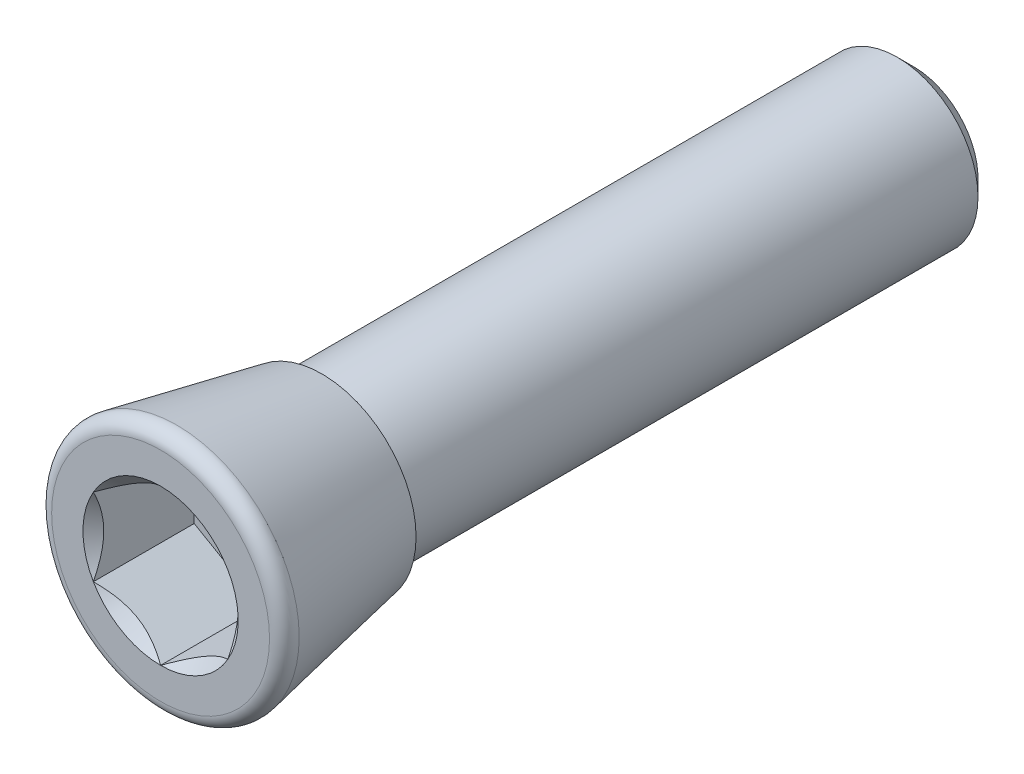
ISO-10303-21;
HEADER;
FILE_DESCRIPTION(('STEP AP214'),'2;1');
FILE_NAME('part.step','',(''),(''),'','','');
FILE_SCHEMA(('AUTOMOTIVE_DESIGN { 1 0 10303 214 1 1 1 1 }'));
ENDSEC;
DATA;
#1=APPLICATION_CONTEXT('core data for automotive mechanical design processes');
#2=APPLICATION_PROTOCOL_DEFINITION('international standard','automotive_design',2000,#1);
#3=PRODUCT_CONTEXT('',#1,'mechanical');
#4=PRODUCT('Part','Part','',(#3));
#5=PRODUCT_RELATED_PRODUCT_CATEGORY('part','',(#4));
#6=PRODUCT_DEFINITION_FORMATION('','',#4);
#7=PRODUCT_DEFINITION_CONTEXT('part definition',#1,'design');
#8=PRODUCT_DEFINITION('design','',#6,#7);
#9=PRODUCT_DEFINITION_SHAPE('','',#8);
#10=(LENGTH_UNIT() NAMED_UNIT(*) SI_UNIT(.MILLI.,.METRE.));
#11=(NAMED_UNIT(*) PLANE_ANGLE_UNIT() SI_UNIT($,.RADIAN.));
#12=(NAMED_UNIT(*) SI_UNIT($,.STERADIAN.) SOLID_ANGLE_UNIT());
#13=UNCERTAINTY_MEASURE_WITH_UNIT(LENGTH_MEASURE(1.E-05),#10,'distance_accuracy_value','');
#14=(GEOMETRIC_REPRESENTATION_CONTEXT(3) GLOBAL_UNCERTAINTY_ASSIGNED_CONTEXT((#13)) GLOBAL_UNIT_ASSIGNED_CONTEXT((#10,
#11,#12)) REPRESENTATION_CONTEXT('',''));
#15=CARTESIAN_POINT('',(0.,0.,0.));
#16=DIRECTION('',(0.,0.,1.));
#17=DIRECTION('',(1.,0.,0.));
#18=AXIS2_PLACEMENT_3D('',#15,#16,#17);
#19=CARTESIAN_POINT('',(0.,0.,0.));
#20=DIRECTION('',(0.,0.,1.));
#21=DIRECTION('',(1.,0.,0.));
#22=AXIS2_PLACEMENT_3D('',#19,#20,#21);
#23=PLANE('',#22);
#24=CARTESIAN_POINT('',(0.,0.,-8.64933125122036E-12));
#25=DIRECTION('',(0.,0.,1.));
#26=DIRECTION('',(1.,0.,0.));
#27=AXIS2_PLACEMENT_3D('',#24,#25,#26);
#28=CIRCLE('',#27,3.50127142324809);
#29=CARTESIAN_POINT('',(3.50127142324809,0.,-8.64933125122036E-12));
#30=VERTEX_POINT('',#29);
#31=EDGE_CURVE('E233',#30,#30,#28,.T.);
#32=ORIENTED_EDGE('',*,*,#31,.F.);
#33=EDGE_LOOP('',(#32));
#34=FACE_BOUND('',#33,.T.);
#35=CARTESIAN_POINT('',(0.,0.,0.));
#36=DIRECTION('',(0.,0.,1.));
#37=DIRECTION('',(1.,0.,0.));
#38=AXIS2_PLACEMENT_3D('',#35,#36,#37);
#39=CIRCLE('',#38,3.);
#40=CARTESIAN_POINT('',(3.,0.,0.));
#41=VERTEX_POINT('',#40);
#42=EDGE_CURVE('E310',#41,#41,#39,.F.);
#43=ORIENTED_EDGE('',*,*,#42,.F.);
#44=EDGE_LOOP('',(#43));
#45=FACE_BOUND('',#44,.T.);
#46=ADVANCED_FACE('F14',(#34,#45),#23,.F.);
#47=CARTESIAN_POINT('',(2.5,-1.44337567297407,2.25));
#48=DIRECTION('',(1.,0.,0.));
#49=DIRECTION('',(0.,-1.,0.));
#50=AXIS2_PLACEMENT_3D('',#47,#48,#49);
#51=PLANE('',#50);
#52=CARTESIAN_POINT('',(2.50000000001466,1.44337567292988,6.0000000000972));
#53=CARTESIAN_POINT('',(2.50000000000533,1.34480479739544,5.95076054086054));
#54=CARTESIAN_POINT('',(2.50000000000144,1.2445963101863,5.9043961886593));
#55=CARTESIAN_POINT('',(2.49999999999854,1.04022304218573,5.81940939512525));
#56=CARTESIAN_POINT('',(2.49999999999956,0.936037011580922,5.78083850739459));
#57=CARTESIAN_POINT('',(2.50000000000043,0.724653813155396,5.71423485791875));
#58=CARTESIAN_POINT('',(2.50000000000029,0.617468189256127,5.68616643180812));
#59=CARTESIAN_POINT('',(2.49999999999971,0.40074718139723,5.64295393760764));
#60=CARTESIAN_POINT('',(2.49999999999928,0.291220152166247,5.62776990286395));
#61=CARTESIAN_POINT('',(2.5000000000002,0.151078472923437,5.61762656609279));
#62=CARTESIAN_POINT('',(2.50000000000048,0.120877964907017,5.61598669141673));
#63=CARTESIAN_POINT('',(2.49999999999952,0.0604529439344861,5.61379762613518));
#64=CARTESIAN_POINT('',(2.49999999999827,0.0302284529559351,5.61324784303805));
#65=CARTESIAN_POINT('',(2.49999999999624,-0.0758674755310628,5.61325068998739));
#66=CARTESIAN_POINT('',(2.49999999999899,-0.151759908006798,5.61672098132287));
#67=CARTESIAN_POINT('',(2.50000000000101,-0.302963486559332,5.63041108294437));
#68=CARTESIAN_POINT('',(2.50000000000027,-0.378274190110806,5.64063560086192));
#69=CARTESIAN_POINT('',(2.49999999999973,-0.528122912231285,5.6673531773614));
#70=CARTESIAN_POINT('',(2.49999999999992,-0.602655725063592,5.68387509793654));
#71=CARTESIAN_POINT('',(2.50000000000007,-0.750290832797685,5.72243537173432));
#72=CARTESIAN_POINT('',(2.50000000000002,-0.823392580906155,5.74447579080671));
#73=CARTESIAN_POINT('',(2.49999999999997,-0.990079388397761,5.80069051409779));
#74=CARTESIAN_POINT('',(2.49999999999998,-1.08310139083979,5.83651478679));
#75=CARTESIAN_POINT('',(2.50000000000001,-1.26562346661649,5.91415730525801));
#76=CARTESIAN_POINT('',(2.50000000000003,-1.35514797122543,5.95591773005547));
#77=CARTESIAN_POINT('',(2.5,-1.44337567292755,6.00000000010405));
#78=B_SPLINE_CURVE_WITH_KNOTS('',3,(#52,#53,#54,#55,#56,#57,#58,#59,#60,#61,#62,#63,#64,#65,#66,
#67,#68,#69,#70,#71,#72,#73,#74,#75,#76,#77),.UNSPECIFIED.,.F.,.F.,(4,2,2,2,2,2,2,2,2,2,2,2,4),
(0.,0.330782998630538,0.663687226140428,0.995450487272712,1.32618083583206,1.41690228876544,
1.50757441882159,1.73514364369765,1.96287164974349,2.19165616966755,2.42052646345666,
2.71929868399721,3.0153381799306),.UNSPECIFIED.);
#79=CARTESIAN_POINT('',(2.49999999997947,1.44337567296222,6.0000000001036));
#80=VERTEX_POINT('',#79);
#81=CARTESIAN_POINT('',(2.49999999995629,-1.44337567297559,6.00000000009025));
#82=VERTEX_POINT('',#81);
#83=EDGE_CURVE('E69',#80,#82,#78,.T.);
#84=ORIENTED_EDGE('',*,*,#83,.F.);
#85=DIRECTION('',(0.,0.,-1.));
#86=VECTOR('',#85,1.);
#87=CARTESIAN_POINT('',(2.5,1.44337567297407,2.25));
#88=LINE('',#87,#86);
#89=CARTESIAN_POINT('',(2.5,1.44337567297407,2.25));
#90=VERTEX_POINT('',#89);
#91=EDGE_CURVE('E75',#80,#90,#88,.T.);
#92=ORIENTED_EDGE('',*,*,#91,.T.);
#93=DIRECTION('',(0.,1.,0.));
#94=VECTOR('',#93,1.);
#95=CARTESIAN_POINT('',(2.5,0.,2.25));
#96=LINE('',#95,#94);
#97=CARTESIAN_POINT('',(2.5,-1.44337567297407,2.25));
#98=VERTEX_POINT('',#97);
#99=EDGE_CURVE('E79',#90,#98,#96,.F.);
#100=ORIENTED_EDGE('',*,*,#99,.T.);
#101=DIRECTION('',(0.,0.,-1.));
#102=VECTOR('',#101,1.);
#103=CARTESIAN_POINT('',(2.5,-1.44337567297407,2.25));
#104=LINE('',#103,#102);
#105=EDGE_CURVE('E77',#98,#82,#104,.F.);
#106=ORIENTED_EDGE('',*,*,#105,.T.);
#107=EDGE_LOOP('',(#84,#92,#100,#106));
#108=FACE_BOUND('',#107,.T.);
#109=ADVANCED_FACE('F73',(#108),#51,.F.);
#110=CARTESIAN_POINT('',(5.,0.,2.25));
#111=DIRECTION('',(0.,0.,-1.));
#112=DIRECTION('',(-1.,0.,0.));
#113=AXIS2_PLACEMENT_3D('',#110,#111,#112);
#114=PLANE('',#113);
#115=DIRECTION('',(0.866025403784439,0.5,0.));
#116=VECTOR('',#115,1.);
#117=CARTESIAN_POINT('',(0.,2.88675134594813,2.25));
#118=LINE('',#117,#116);
#119=CARTESIAN_POINT('',(0.,2.88675134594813,2.25));
#120=VERTEX_POINT('',#119);
#121=CARTESIAN_POINT('',(-2.5,1.44337567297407,2.25));
#122=VERTEX_POINT('',#121);
#123=EDGE_CURVE('E267',#120,#122,#118,.F.);
#124=ORIENTED_EDGE('',*,*,#123,.T.);
#125=DIRECTION('',(0.,1.,0.));
#126=VECTOR('',#125,1.);
#127=CARTESIAN_POINT('',(-2.5,1.44337567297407,2.25));
#128=LINE('',#127,#126);
#129=CARTESIAN_POINT('',(-2.5,-1.44337567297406,2.25));
#130=VERTEX_POINT('',#129);
#131=EDGE_CURVE('E273',#122,#130,#128,.F.);
#132=ORIENTED_EDGE('',*,*,#131,.T.);
#133=DIRECTION('',(-0.866025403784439,0.5,0.));
#134=VECTOR('',#133,1.);
#135=CARTESIAN_POINT('',(-2.5,-1.44337567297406,2.25));
#136=LINE('',#135,#134);
#137=CARTESIAN_POINT('',(0.,-2.88675134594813,2.25));
#138=VERTEX_POINT('',#137);
#139=EDGE_CURVE('E279',#130,#138,#136,.F.);
#140=ORIENTED_EDGE('',*,*,#139,.T.);
#141=DIRECTION('',(-0.866025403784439,-0.5,0.));
#142=VECTOR('',#141,1.);
#143=CARTESIAN_POINT('',(0.,-2.88675134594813,2.25));
#144=LINE('',#143,#142);
#145=EDGE_CURVE('E100',#138,#98,#144,.F.);
#146=ORIENTED_EDGE('',*,*,#145,.T.);
#147=ORIENTED_EDGE('',*,*,#99,.F.);
#148=DIRECTION('',(0.866025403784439,-0.5,0.));
#149=VECTOR('',#148,1.);
#150=CARTESIAN_POINT('',(2.5,1.44337567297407,2.25));
#151=LINE('',#150,#149);
#152=EDGE_CURVE('E99',#90,#120,#151,.F.);
#153=ORIENTED_EDGE('',*,*,#152,.T.);
#154=EDGE_LOOP('',(#124,#132,#140,#146,#147,#153));
#155=FACE_BOUND('',#154,.T.);
#156=ADVANCED_FACE('F182',(#155),#114,.F.);
#157=CARTESIAN_POINT('',(2.5,1.44337567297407,2.25));
#158=DIRECTION('',(0.5,0.866025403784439,0.));
#159=DIRECTION('',(0.866025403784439,-0.5,0.));
#160=AXIS2_PLACEMENT_3D('',#157,#158,#159);
#161=PLANE('',#160);
#162=CARTESIAN_POINT('',(2.49999999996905,1.44337567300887,6.0000000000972));
#163=CARTESIAN_POINT('',(2.41407377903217,1.49298519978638,5.9504380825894));
#164=CARTESIAN_POINT('',(2.32671086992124,1.54342419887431,5.90378750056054));
#165=CARTESIAN_POINT('',(2.14856893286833,1.64627449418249,5.81837227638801));
#166=CARTESIAN_POINT('',(2.05777297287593,1.69869556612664,5.77965514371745));
#167=CARTESIAN_POINT('',(1.87468737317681,1.80440008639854,5.71333243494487));
#168=CARTESIAN_POINT('',(1.78244433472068,1.85765662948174,5.68556020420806));
#169=CARTESIAN_POINT('',(1.59592809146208,1.9653418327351,5.64277179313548));
#170=CARTESIAN_POINT('',(1.5016605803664,2.01976720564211,5.62772368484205));
#171=CARTESIAN_POINT('',(1.33918618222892,2.11357184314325,5.61414605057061));
#172=CARTESIAN_POINT('',(1.27118905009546,2.15283000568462,5.61213672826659));
#173=CARTESIAN_POINT('',(1.13530604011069,2.23128209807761,5.61552620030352));
#174=CARTESIAN_POINT('',(1.06742020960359,2.27047600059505,5.62092759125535));
#175=CARTESIAN_POINT('',(0.932289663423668,2.34849365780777,5.6388311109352));
#176=CARTESIAN_POINT('',(0.865045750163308,2.38731694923,5.65134117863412));
#177=CARTESIAN_POINT('',(0.73172077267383,2.46429216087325,5.68277536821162));
#178=CARTESIAN_POINT('',(0.665639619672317,2.50244413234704,5.70169899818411));
#179=CARTESIAN_POINT('',(0.496416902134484,2.60014491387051,5.75786430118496));
#180=CARTESIAN_POINT('',(0.394323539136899,2.65908854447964,5.79933497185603));
#181=CARTESIAN_POINT('',(0.244203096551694,2.74576062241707,5.86934112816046));
#182=CARTESIAN_POINT('',(0.194731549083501,2.77432303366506,5.89393775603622));
#183=CARTESIAN_POINT('',(0.0967044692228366,2.83091899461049,5.94537285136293));
#184=CARTESIAN_POINT('',(0.0481483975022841,2.85895285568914,5.97220994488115));
#185=CARTESIAN_POINT('',(3.89630262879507E-11,2.88675134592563,6.00000000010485));
#186=B_SPLINE_CURVE_WITH_KNOTS('',3,(#162,#163,#164,#165,#166,#167,#168,#169,#170,#171,#172,
#173,#174,#175,#176,#177,#178,#179,#180,#181,#182,#183,#184,#185),.UNSPECIFIED.,.F.,.F.,(4,2,2,
2,2,2,2,2,2,2,2,4),(0.,0.332957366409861,0.667853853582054,0.997433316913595,1.32618330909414,
1.56147590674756,1.79685096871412,2.03248941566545,2.26810979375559,2.64223182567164,
2.82878537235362,3.01522534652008),.UNSPECIFIED.);
#187=CARTESIAN_POINT('',(0.,2.88675134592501,6.0000000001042));
#188=VERTEX_POINT('',#187);
#189=EDGE_CURVE('E96',#80,#188,#186,.T.);
#190=ORIENTED_EDGE('',*,*,#189,.T.);
#191=DIRECTION('',(0.,0.,-1.));
#192=VECTOR('',#191,1.);
#193=CARTESIAN_POINT('',(0.,2.88675134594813,2.25));
#194=LINE('',#193,#192);
#195=EDGE_CURVE('E106',#188,#120,#194,.T.);
#196=ORIENTED_EDGE('',*,*,#195,.T.);
#197=ORIENTED_EDGE('',*,*,#152,.F.);
#198=ORIENTED_EDGE('',*,*,#91,.F.);
#199=EDGE_LOOP('',(#190,#196,#197,#198));
#200=FACE_BOUND('',#199,.T.);
#201=ADVANCED_FACE('F94',(#200),#161,.F.);
#202=CARTESIAN_POINT('',(0.,-2.88675134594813,2.25));
#203=DIRECTION('',(0.5,-0.866025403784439,0.));
#204=DIRECTION('',(-0.866025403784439,-0.5,0.));
#205=AXIS2_PLACEMENT_3D('',#202,#203,#204);
#206=PLANE('',#205);
#207=CARTESIAN_POINT('',(4.47840873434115E-11,-2.88675134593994,6.0000000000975));
#208=CARTESIAN_POINT('',(0.0859262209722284,-2.83714181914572,5.95043808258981));
#209=CARTESIAN_POINT('',(0.173289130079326,-2.7867028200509,5.90378750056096));
#210=CARTESIAN_POINT('',(0.351431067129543,-2.68385252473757,5.81837227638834));
#211=CARTESIAN_POINT('',(0.442227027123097,-2.63143145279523,5.77965514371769));
#212=CARTESIAN_POINT('',(0.625312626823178,-2.52572693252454,5.71333243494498));
#213=CARTESIAN_POINT('',(0.717555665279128,-2.4724703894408,5.68556020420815));
#214=CARTESIAN_POINT('',(0.904071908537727,-2.36478518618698,5.64277179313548));
#215=CARTESIAN_POINT('',(0.998339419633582,-2.31035981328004,5.627723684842));
#216=CARTESIAN_POINT('',(1.16081381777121,-2.2165551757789,5.61414605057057));
#217=CARTESIAN_POINT('',(1.22881094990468,-2.17729701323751,5.61213672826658));
#218=CARTESIAN_POINT('',(1.36469395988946,-2.09884492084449,5.61552620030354));
#219=CARTESIAN_POINT('',(1.43257979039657,-2.05965101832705,5.62092759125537));
#220=CARTESIAN_POINT('',(1.56771033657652,-1.98163336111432,5.63883111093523));
#221=CARTESIAN_POINT('',(1.63495424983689,-1.94281006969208,5.65134117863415));
#222=CARTESIAN_POINT('',(1.76827922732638,-1.86583485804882,5.68277536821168));
#223=CARTESIAN_POINT('',(1.8343603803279,-1.82768288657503,5.7016989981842));
#224=CARTESIAN_POINT('',(2.00358309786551,-1.7299821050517,5.757864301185));
#225=CARTESIAN_POINT('',(2.10567646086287,-1.67103847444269,5.79933497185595));
#226=CARTESIAN_POINT('',(2.25579690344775,-1.58436639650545,5.86934112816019));
#227=CARTESIAN_POINT('',(2.30526845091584,-1.55580398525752,5.89393775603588));
#228=CARTESIAN_POINT('',(2.40329553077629,-1.49920802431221,5.94537285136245));
#229=CARTESIAN_POINT('',(2.45185160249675,-1.47117416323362,5.9722099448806));
#230=CARTESIAN_POINT('',(2.49999999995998,-1.44337567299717,6.0000000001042));
#231=B_SPLINE_CURVE_WITH_KNOTS('',3,(#207,#208,#209,#210,#211,#212,#213,#214,#215,#216,#217,
#218,#219,#220,#221,#222,#223,#224,#225,#226,#227,#228,#229,#230),.UNSPECIFIED.,.F.,.F.,(4,2,2,
2,2,2,2,2,2,2,2,4),(0.,0.332957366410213,0.667853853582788,0.997433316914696,1.32618330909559,
1.56147590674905,1.79685096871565,2.03248941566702,2.2681097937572,2.64223182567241,
2.82878537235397,3.01522534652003),.UNSPECIFIED.);
#232=CARTESIAN_POINT('',(-2.36829088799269E-11,-2.88675134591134,6.00000000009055));
#233=VERTEX_POINT('',#232);
#234=EDGE_CURVE('E105',#233,#82,#231,.T.);
#235=ORIENTED_EDGE('',*,*,#234,.T.);
#236=ORIENTED_EDGE('',*,*,#105,.F.);
#237=ORIENTED_EDGE('',*,*,#145,.F.);
#238=DIRECTION('',(0.,0.,-1.));
#239=VECTOR('',#238,1.);
#240=CARTESIAN_POINT('',(0.,-2.88675134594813,2.25));
#241=LINE('',#240,#239);
#242=EDGE_CURVE('E276',#138,#233,#241,.F.);
#243=ORIENTED_EDGE('',*,*,#242,.T.);
#244=EDGE_LOOP('',(#235,#236,#237,#243));
#245=FACE_BOUND('',#244,.T.);
#246=ADVANCED_FACE('F172',(#245),#206,.F.);
#247=CARTESIAN_POINT('',(-2.5,-1.44337567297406,2.25));
#248=DIRECTION('',(-0.5,-0.866025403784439,0.));
#249=DIRECTION('',(-0.866025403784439,0.5,0.));
#250=AXIS2_PLACEMENT_3D('',#247,#248,#249);
#251=PLANE('',#250);
#252=CARTESIAN_POINT('',(-2.49999999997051,-1.44337567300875,6.0000000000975));
#253=CARTESIAN_POINT('',(-2.41407377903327,-1.49298519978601,5.95043808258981));
#254=CARTESIAN_POINT('',(-2.32671086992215,-1.54342419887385,5.90378750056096));
#255=CARTESIAN_POINT('',(-2.14856893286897,-1.64627449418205,5.81837227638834));
#256=CARTESIAN_POINT('',(-2.05777297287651,-1.69869556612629,5.77965514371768));
#257=CARTESIAN_POINT('',(-1.87468737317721,-1.80440008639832,5.71333243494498));
#258=CARTESIAN_POINT('',(-1.78244433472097,-1.85765662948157,5.68556020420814));
#259=CARTESIAN_POINT('',(-1.59592809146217,-1.96534183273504,5.64277179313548));
#260=CARTESIAN_POINT('',(-1.5016605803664,-2.01976720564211,5.627723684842));
#261=CARTESIAN_POINT('',(-1.33918618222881,-2.11357184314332,5.61414605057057));
#262=CARTESIAN_POINT('',(-1.27118905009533,-2.15283000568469,5.61213672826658));
#263=CARTESIAN_POINT('',(-1.13530604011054,-2.2312820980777,5.61552620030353));
#264=CARTESIAN_POINT('',(-1.06742020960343,-2.27047600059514,5.62092759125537));
#265=CARTESIAN_POINT('',(-0.932289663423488,-2.34849365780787,5.63883111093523));
#266=CARTESIAN_POINT('',(-0.865045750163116,-2.38731694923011,5.65134117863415));
#267=CARTESIAN_POINT('',(-0.731720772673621,-2.46429216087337,5.68277536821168));
#268=CARTESIAN_POINT('',(-0.665639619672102,-2.50244413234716,5.7016989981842));
#269=CARTESIAN_POINT('',(-0.496416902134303,-2.60014491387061,5.75786430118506));
#270=CARTESIAN_POINT('',(-0.394323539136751,-2.65908854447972,5.7993349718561));
#271=CARTESIAN_POINT('',(-0.244203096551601,-2.74576062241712,5.8693411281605));
#272=CARTESIAN_POINT('',(-0.194731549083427,-2.7743230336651,5.89393775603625));
#273=CARTESIAN_POINT('',(-0.0967044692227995,-2.8309189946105,5.94537285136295));
#274=CARTESIAN_POINT('',(-0.048148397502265,-2.85895285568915,5.97220994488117));
#275=CARTESIAN_POINT('',(-3.89606769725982E-11,-2.88675134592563,6.00000000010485));
#276=B_SPLINE_CURVE_WITH_KNOTS('',3,(#252,#253,#254,#255,#256,#257,#258,#259,#260,#261,#262,
#263,#264,#265,#266,#267,#268,#269,#270,#271,#272,#273,#274,#275),.UNSPECIFIED.,.F.,.F.,(4,2,2,
2,2,2,2,2,2,2,2,4),(0.,0.332957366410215,0.667853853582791,0.997433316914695,1.32618330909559,
1.56147590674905,1.79685096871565,2.03248941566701,2.2681097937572,2.64223182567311,
2.82878537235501,3.01522534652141),.UNSPECIFIED.);
#277=CARTESIAN_POINT('',(-2.49999999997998,-1.44337567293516,6.0000000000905));
#278=VERTEX_POINT('',#277);
#279=EDGE_CURVE('E155',#278,#233,#276,.T.);
#280=ORIENTED_EDGE('',*,*,#279,.T.);
#281=ORIENTED_EDGE('',*,*,#242,.F.);
#282=ORIENTED_EDGE('',*,*,#139,.F.);
#283=DIRECTION('',(0.,0.,1.));
#284=VECTOR('',#283,1.);
#285=CARTESIAN_POINT('',(-2.5,-1.44337567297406,2.25));
#286=LINE('',#285,#284);
#287=EDGE_CURVE('E270',#130,#278,#286,.T.);
#288=ORIENTED_EDGE('',*,*,#287,.T.);
#289=EDGE_LOOP('',(#280,#281,#282,#288));
#290=FACE_BOUND('',#289,.T.);
#291=ADVANCED_FACE('F168',(#290),#251,.F.);
#292=CARTESIAN_POINT('',(-2.5,1.44337567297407,2.25));
#293=DIRECTION('',(-1.,0.,0.));
#294=DIRECTION('',(0.,0.,1.));
#295=AXIS2_PLACEMENT_3D('',#292,#293,#294);
#296=PLANE('',#295);
#297=CARTESIAN_POINT('',(-2.5000000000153,1.44337567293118,6.0000000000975));
#298=CARTESIAN_POINT('',(-2.5000000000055,1.34415661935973,5.95043808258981));
#299=CARTESIAN_POINT('',(-2.50000000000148,1.24327862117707,5.90378750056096));
#300=CARTESIAN_POINT('',(-2.49999999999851,1.03757803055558,5.81837227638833));
#301=CARTESIAN_POINT('',(-2.4999999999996,0.932735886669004,5.77965514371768));
#302=CARTESIAN_POINT('',(-2.50000000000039,0.721326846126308,5.71333243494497));
#303=CARTESIAN_POINT('',(-2.5000000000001,0.61481375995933,5.68556020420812));
#304=CARTESIAN_POINT('',(-2.4999999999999,0.399443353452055,5.64277179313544));
#305=CARTESIAN_POINT('',(-2.49999999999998,0.290592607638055,5.62772368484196));
#306=CARTESIAN_POINT('',(-2.50000000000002,0.102983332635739,5.61414605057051));
#307=CARTESIAN_POINT('',(-2.5,0.0244670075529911,5.61213672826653));
#308=CARTESIAN_POINT('',(-2.5,-0.132437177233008,5.61552620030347));
#309=CARTESIAN_POINT('',(-2.5,-0.210824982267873,5.6209275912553));
#310=CARTESIAN_POINT('',(-2.5,-0.366860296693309,5.63883111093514));
#311=CARTESIAN_POINT('',(-2.5,-0.444506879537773,5.65134117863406));
#312=CARTESIAN_POINT('',(-2.5,-0.598457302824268,5.68277536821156));
#313=CARTESIAN_POINT('',(-2.5,-0.674761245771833,5.70169899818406));
#314=CARTESIAN_POINT('',(-2.5,-0.870162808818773,5.75786430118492));
#315=CARTESIAN_POINT('',(-2.5,-0.988050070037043,5.79933497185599));
#316=CARTESIAN_POINT('',(-2.5,-1.16139422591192,5.86934112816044));
#317=CARTESIAN_POINT('',(-2.5,-1.21851904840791,5.89393775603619));
#318=CARTESIAN_POINT('',(-2.5,-1.33171097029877,5.94537285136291));
#319=CARTESIAN_POINT('',(-2.5,-1.38777869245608,5.97220994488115));
#320=CARTESIAN_POINT('',(-2.5,-1.44337567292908,6.00000000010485));
#321=B_SPLINE_CURVE_WITH_KNOTS('',3,(#297,#298,#299,#300,#301,#302,#303,#304,#305,#306,#307,
#308,#309,#310,#311,#312,#313,#314,#315,#316,#317,#318,#319,#320),.UNSPECIFIED.,.F.,.F.,(4,2,2,
2,2,2,2,2,2,2,2,4),(0.,0.332957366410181,0.667853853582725,0.997433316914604,1.32618330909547,
1.56147590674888,1.79685096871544,2.03248941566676,2.2681097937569,2.64223182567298,
2.82878537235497,3.01522534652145),.UNSPECIFIED.);
#322=CARTESIAN_POINT('',(-2.49999999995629,1.44337567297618,6.00000000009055));
#323=VERTEX_POINT('',#322);
#324=EDGE_CURVE('E115',#323,#278,#321,.T.);
#325=ORIENTED_EDGE('',*,*,#324,.T.);
#326=ORIENTED_EDGE('',*,*,#287,.F.);
#327=ORIENTED_EDGE('',*,*,#131,.F.);
#328=DIRECTION('',(0.,0.,-1.));
#329=VECTOR('',#328,1.);
#330=CARTESIAN_POINT('',(-2.5,1.44337567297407,2.25));
#331=LINE('',#330,#329);
#332=EDGE_CURVE('E262',#122,#323,#331,.F.);
#333=ORIENTED_EDGE('',*,*,#332,.T.);
#334=EDGE_LOOP('',(#325,#326,#327,#333));
#335=FACE_BOUND('',#334,.T.);
#336=ADVANCED_FACE('F171',(#335),#296,.F.);
#337=CARTESIAN_POINT('',(0.,2.88675134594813,2.25));
#338=DIRECTION('',(-0.5,0.866025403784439,0.));
#339=DIRECTION('',(0.866025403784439,0.5,0.));
#340=AXIS2_PLACEMENT_3D('',#337,#338,#339);
#341=PLANE('',#340);
#342=CARTESIAN_POINT('',(-4.47876154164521E-11,2.88675134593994,6.0000000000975));
#343=CARTESIAN_POINT('',(-0.0859262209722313,2.83714181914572,5.95043808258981));
#344=CARTESIAN_POINT('',(-0.173289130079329,2.7867028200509,5.90378750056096));
#345=CARTESIAN_POINT('',(-0.351431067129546,2.68385252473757,5.81837227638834));
#346=CARTESIAN_POINT('',(-0.442227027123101,2.63143145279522,5.77965514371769));
#347=CARTESIAN_POINT('',(-0.625312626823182,2.52572693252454,5.71333243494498));
#348=CARTESIAN_POINT('',(-0.717555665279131,2.4724703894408,5.68556020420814));
#349=CARTESIAN_POINT('',(-0.904071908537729,2.36478518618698,5.64277179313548));
#350=CARTESIAN_POINT('',(-0.998339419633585,2.31035981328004,5.627723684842));
#351=CARTESIAN_POINT('',(-1.16081381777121,2.2165551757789,5.61414605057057));
#352=CARTESIAN_POINT('',(-1.22881094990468,2.17729701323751,5.61213672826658));
#353=CARTESIAN_POINT('',(-1.36469395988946,2.09884492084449,5.61552620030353));
#354=CARTESIAN_POINT('',(-1.43257979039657,2.05965101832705,5.62092759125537));
#355=CARTESIAN_POINT('',(-1.56771033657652,1.98163336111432,5.63883111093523));
#356=CARTESIAN_POINT('',(-1.63495424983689,1.94281006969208,5.65134117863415));
#357=CARTESIAN_POINT('',(-1.76827922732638,1.86583485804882,5.68277536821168));
#358=CARTESIAN_POINT('',(-1.8343603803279,1.82768288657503,5.7016989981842));
#359=CARTESIAN_POINT('',(-2.0035830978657,1.72998210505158,5.75786430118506));
#360=CARTESIAN_POINT('',(-2.10567646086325,1.67103847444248,5.7993349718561));
#361=CARTESIAN_POINT('',(-2.2557969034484,1.58436639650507,5.86934112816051));
#362=CARTESIAN_POINT('',(-2.30526845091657,1.5558039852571,5.89393775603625));
#363=CARTESIAN_POINT('',(-2.4032955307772,1.49920802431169,5.94537285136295));
#364=CARTESIAN_POINT('',(-2.45185160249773,1.47117416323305,5.97220994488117));
#365=CARTESIAN_POINT('',(-2.49999999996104,1.44337567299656,6.00000000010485));
#366=B_SPLINE_CURVE_WITH_KNOTS('',3,(#342,#343,#344,#345,#346,#347,#348,#349,#350,#351,#352,
#353,#354,#355,#356,#357,#358,#359,#360,#361,#362,#363,#364,#365),.UNSPECIFIED.,.F.,.F.,(4,2,2,
2,2,2,2,2,2,2,2,4),(0.,0.332957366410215,0.66785385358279,0.997433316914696,1.32618330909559,
1.56147590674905,1.79685096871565,2.03248941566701,2.2681097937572,2.6422318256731,
2.82878537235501,3.01522534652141),.UNSPECIFIED.);
#367=EDGE_CURVE('E112',#188,#323,#366,.T.);
#368=ORIENTED_EDGE('',*,*,#367,.T.);
#369=ORIENTED_EDGE('',*,*,#332,.F.);
#370=ORIENTED_EDGE('',*,*,#123,.F.);
#371=ORIENTED_EDGE('',*,*,#195,.F.);
#372=EDGE_LOOP('',(#368,#369,#370,#371));
#373=FACE_BOUND('',#372,.T.);
#374=ADVANCED_FACE('F132',(#373),#341,.F.);
#375=CARTESIAN_POINT('',(0.,0.,6.00000000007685));
#376=DIRECTION('',(0.,0.,1.));
#377=DIRECTION('',(1.,0.,0.));
#378=AXIS2_PLACEMENT_3D('',#375,#376,#377);
#379=CONICAL_SURFACE('',#378,2.88675134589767,0.785398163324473);
#380=ORIENTED_EDGE('',*,*,#189,.F.);
#381=CARTESIAN_POINT('',(0.,0.,6.00000000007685));
#382=DIRECTION('',(0.,0.,1.));
#383=DIRECTION('',(1.,0.,0.));
#384=AXIS2_PLACEMENT_3D('',#381,#382,#383);
#385=CIRCLE('',#384,2.88675134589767);
#386=EDGE_CURVE('E88',#188,#80,#385,.F.);
#387=ORIENTED_EDGE('',*,*,#386,.F.);
#388=EDGE_LOOP('',(#380,#387));
#389=FACE_BOUND('',#388,.T.);
#390=ADVANCED_FACE('F104',(#389),#379,.F.);
#391=CARTESIAN_POINT('',(0.,0.,6.00000000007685));
#392=DIRECTION('',(0.,0.,1.));
#393=DIRECTION('',(1.,0.,0.));
#394=AXIS2_PLACEMENT_3D('',#391,#392,#393);
#395=CONICAL_SURFACE('',#394,2.88675134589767,0.785398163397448);
#396=ORIENTED_EDGE('',*,*,#83,.T.);
#397=CARTESIAN_POINT('',(0.,0.,6.00000000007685));
#398=DIRECTION('',(0.,0.,1.));
#399=DIRECTION('',(1.,0.,0.));
#400=AXIS2_PLACEMENT_3D('',#397,#398,#399);
#401=CIRCLE('',#400,2.88675134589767);
#402=EDGE_CURVE('E81',#80,#82,#401,.F.);
#403=ORIENTED_EDGE('',*,*,#402,.F.);
#404=EDGE_LOOP('',(#396,#403));
#405=FACE_BOUND('',#404,.T.);
#406=ADVANCED_FACE('F82',(#405),#395,.F.);
#407=CARTESIAN_POINT('',(0.,0.,6.00000000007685));
#408=DIRECTION('',(0.,0.,1.));
#409=DIRECTION('',(1.,0.,0.));
#410=AXIS2_PLACEMENT_3D('',#407,#408,#409);
#411=CONICAL_SURFACE('',#410,2.88675134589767,0.785398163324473);
#412=ORIENTED_EDGE('',*,*,#234,.F.);
#413=CARTESIAN_POINT('',(0.,0.,6.00000000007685));
#414=DIRECTION('',(0.,0.,1.));
#415=DIRECTION('',(1.,0.,0.));
#416=AXIS2_PLACEMENT_3D('',#413,#414,#415);
#417=CIRCLE('',#416,2.88675134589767);
#418=EDGE_CURVE('E87',#82,#233,#417,.F.);
#419=ORIENTED_EDGE('',*,*,#418,.F.);
#420=EDGE_LOOP('',(#412,#419));
#421=FACE_BOUND('',#420,.T.);
#422=ADVANCED_FACE('F151',(#421),#411,.F.);
#423=CARTESIAN_POINT('',(0.,0.,6.00000000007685));
#424=DIRECTION('',(0.,0.,1.));
#425=DIRECTION('',(1.,0.,0.));
#426=AXIS2_PLACEMENT_3D('',#423,#424,#425);
#427=CONICAL_SURFACE('',#426,2.88675134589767,0.785398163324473);
#428=ORIENTED_EDGE('',*,*,#279,.F.);
#429=CARTESIAN_POINT('',(0.,0.,6.00000000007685));
#430=DIRECTION('',(0.,0.,1.));
#431=DIRECTION('',(1.,0.,0.));
#432=AXIS2_PLACEMENT_3D('',#429,#430,#431);
#433=CIRCLE('',#432,2.88675134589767);
#434=EDGE_CURVE('E314',#233,#278,#433,.F.);
#435=ORIENTED_EDGE('',*,*,#434,.F.);
#436=EDGE_LOOP('',(#428,#435));
#437=FACE_BOUND('',#436,.T.);
#438=ADVANCED_FACE('F146',(#437),#427,.F.);
#439=CARTESIAN_POINT('',(0.,0.,6.00000000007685));
#440=DIRECTION('',(0.,0.,1.));
#441=DIRECTION('',(1.,0.,0.));
#442=AXIS2_PLACEMENT_3D('',#439,#440,#441);
#443=CONICAL_SURFACE('',#442,2.88675134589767,0.785398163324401);
#444=ORIENTED_EDGE('',*,*,#324,.F.);
#445=CARTESIAN_POINT('',(0.,0.,6.00000000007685));
#446=DIRECTION('',(0.,0.,1.));
#447=DIRECTION('',(1.,0.,0.));
#448=AXIS2_PLACEMENT_3D('',#445,#446,#447);
#449=CIRCLE('',#448,2.88675134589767);
#450=EDGE_CURVE('E312',#278,#323,#449,.F.);
#451=ORIENTED_EDGE('',*,*,#450,.F.);
#452=EDGE_LOOP('',(#444,#451));
#453=FACE_BOUND('',#452,.T.);
#454=ADVANCED_FACE('F139',(#453),#443,.F.);
#455=CARTESIAN_POINT('',(0.,0.,6.00000000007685));
#456=DIRECTION('',(0.,0.,1.));
#457=DIRECTION('',(1.,0.,0.));
#458=AXIS2_PLACEMENT_3D('',#455,#456,#457);
#459=CONICAL_SURFACE('',#458,2.88675134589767,0.785398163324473);
#460=ORIENTED_EDGE('',*,*,#367,.F.);
#461=CARTESIAN_POINT('',(0.,0.,6.00000000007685));
#462=DIRECTION('',(0.,0.,1.));
#463=DIRECTION('',(1.,0.,0.));
#464=AXIS2_PLACEMENT_3D('',#461,#462,#463);
#465=CIRCLE('',#464,2.88675134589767);
#466=EDGE_CURVE('E111',#323,#188,#465,.F.);
#467=ORIENTED_EDGE('',*,*,#466,.F.);
#468=EDGE_LOOP('',(#460,#467));
#469=FACE_BOUND('',#468,.T.);
#470=ADVANCED_FACE('F135',(#469),#459,.F.);
#471=CARTESIAN_POINT('',(0.,0.,6.));
#472=DIRECTION('',(0.,0.,1.));
#473=DIRECTION('',(1.,0.,0.));
#474=AXIS2_PLACEMENT_3D('',#471,#472,#473);
#475=PLANE('',#474);
#476=CARTESIAN_POINT('',(0.,0.,6.));
#477=DIRECTION('',(0.,0.,-1.));
#478=DIRECTION('',(-1.,0.,0.));
#479=AXIS2_PLACEMENT_3D('',#476,#477,#478);
#480=CIRCLE('',#479,4.0513);
#481=CARTESIAN_POINT('',(-4.0513,0.,6.));
#482=VERTEX_POINT('',#481);
#483=CARTESIAN_POINT('',(4.0513,0.,6.));
#484=VERTEX_POINT('',#483);
#485=EDGE_CURVE('E236',#482,#484,#480,.T.);
#486=ORIENTED_EDGE('',*,*,#485,.F.);
#487=CARTESIAN_POINT('',(0.,0.,6.));
#488=DIRECTION('',(0.,0.,-1.));
#489=DIRECTION('',(1.,0.,0.));
#490=AXIS2_PLACEMENT_3D('',#487,#488,#489);
#491=CIRCLE('',#490,4.0513);
#492=EDGE_CURVE('E30',#484,#482,#491,.T.);
#493=ORIENTED_EDGE('',*,*,#492,.F.);
#494=EDGE_LOOP('',(#486,#493));
#495=FACE_BOUND('',#494,.T.);
#496=ORIENTED_EDGE('',*,*,#450,.T.);
#497=ORIENTED_EDGE('',*,*,#466,.T.);
#498=ORIENTED_EDGE('',*,*,#386,.T.);
#499=ORIENTED_EDGE('',*,*,#402,.T.);
#500=ORIENTED_EDGE('',*,*,#418,.T.);
#501=ORIENTED_EDGE('',*,*,#434,.T.);
#502=EDGE_LOOP('',(#496,#497,#498,#499,#500,#501));
#503=FACE_BOUND('',#502,.T.);
#504=ADVANCED_FACE('F109',(#495,#503),#475,.T.);
#505=CARTESIAN_POINT('',(0.,0.,5.492));
#506=DIRECTION('',(0.,0.,-1.));
#507=DIRECTION('',(-1.,0.,0.));
#508=AXIS2_PLACEMENT_3D('',#505,#506,#507);
#509=TOROIDAL_SURFACE('',#508,4.0513,0.508);
#510=ORIENTED_EDGE('',*,*,#485,.T.);
#511=ORIENTED_EDGE('',*,*,#492,.T.);
#512=EDGE_LOOP('',(#510,#511));
#513=FACE_BOUND('',#512,.T.);
#514=CARTESIAN_POINT('',(0.,0.,5.39506903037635));
#515=DIRECTION('',(0.,0.,1.));
#516=DIRECTION('',(1.,0.,0.));
#517=AXIS2_PLACEMENT_3D('',#514,#515,#516);
#518=CIRCLE('',#517,4.54996660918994);
#519=CARTESIAN_POINT('',(4.54996660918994,0.,5.39506903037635));
#520=VERTEX_POINT('',#519);
#521=EDGE_CURVE('E230',#520,#520,#518,.F.);
#522=ORIENTED_EDGE('',*,*,#521,.F.);
#523=EDGE_LOOP('',(#522));
#524=FACE_BOUND('',#523,.T.);
#525=ADVANCED_FACE('F214',(#513,#524),#509,.T.);
#526=CARTESIAN_POINT('',(0.,0.,5.39506903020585));
#527=DIRECTION('',(0.,0.,1.));
#528=DIRECTION('',(1.,0.,0.));
#529=AXIS2_PLACEMENT_3D('',#526,#527,#528);
#530=CONICAL_SURFACE('',#529,4.54996660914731,0.191986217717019);
#531=ORIENTED_EDGE('',*,*,#31,.T.);
#532=EDGE_LOOP('',(#531));
#533=FACE_BOUND('',#532,.T.);
#534=ORIENTED_EDGE('',*,*,#521,.T.);
#535=EDGE_LOOP('',(#534));
#536=FACE_BOUND('',#535,.T.);
#537=ADVANCED_FACE('F204',(#533,#536),#530,.T.);
#538=CARTESIAN_POINT('',(0.,0.,-22.));
#539=DIRECTION('',(0.,0.,1.));
#540=DIRECTION('',(1.,0.,0.));
#541=AXIS2_PLACEMENT_3D('',#538,#539,#540);
#542=CYLINDRICAL_SURFACE('',#541,3.);
#543=CARTESIAN_POINT('',(0.,0.,-21.4));
#544=DIRECTION('',(0.,0.,-1.));
#545=DIRECTION('',(-1.,0.,0.));
#546=AXIS2_PLACEMENT_3D('',#543,#544,#545);
#547=CIRCLE('',#546,3.);
#548=CARTESIAN_POINT('',(-3.,0.,-21.4));
#549=VERTEX_POINT('',#548);
#550=EDGE_CURVE('E9',#549,#549,#547,.F.);
#551=ORIENTED_EDGE('',*,*,#550,.T.);
#552=EDGE_LOOP('',(#551));
#553=FACE_BOUND('',#552,.T.);
#554=ORIENTED_EDGE('',*,*,#42,.T.);
#555=EDGE_LOOP('',(#554));
#556=FACE_BOUND('',#555,.T.);
#557=ADVANCED_FACE('F208',(#553,#556),#542,.T.);
#558=CARTESIAN_POINT('',(0.,0.,-22.));
#559=DIRECTION('',(0.,0.,-1.));
#560=DIRECTION('',(-1.,0.,0.));
#561=AXIS2_PLACEMENT_3D('',#558,#559,#560);
#562=PLANE('',#561);
#563=CARTESIAN_POINT('',(0.,0.,-22.));
#564=DIRECTION('',(0.,0.,-1.));
#565=DIRECTION('',(-1.,0.,0.));
#566=AXIS2_PLACEMENT_3D('',#563,#564,#565);
#567=CIRCLE('',#566,2.4);
#568=CARTESIAN_POINT('',(-2.4,0.,-22.));
#569=VERTEX_POINT('',#568);
#570=EDGE_CURVE('E23',#569,#569,#567,.T.);
#571=ORIENTED_EDGE('',*,*,#570,.T.);
#572=EDGE_LOOP('',(#571));
#573=FACE_BOUND('',#572,.T.);
#574=ADVANCED_FACE('F220',(#573),#562,.T.);
#575=CARTESIAN_POINT('',(0.,0.,-22.));
#576=DIRECTION('',(0.,0.,1.));
#577=DIRECTION('',(1.,0.,0.));
#578=AXIS2_PLACEMENT_3D('',#575,#576,#577);
#579=CONICAL_SURFACE('',#578,2.4,0.78539816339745);
#580=ORIENTED_EDGE('',*,*,#550,.F.);
#581=EDGE_LOOP('',(#580));
#582=FACE_BOUND('',#581,.T.);
#583=ORIENTED_EDGE('',*,*,#570,.F.);
#584=EDGE_LOOP('',(#583));
#585=FACE_BOUND('',#584,.T.);
#586=ADVANCED_FACE('F16',(#582,#585),#579,.T.);
#587=CLOSED_SHELL('',(#46,#109,#156,#201,#246,#291,#336,#374,#390,#406,#422,#438,#454,#470,#504,
#525,#537,#557,#574,#586));
#588=MANIFOLD_SOLID_BREP('B1',#587);
#589=ADVANCED_BREP_SHAPE_REPRESENTATION('',(#18,#588),#14);
#590=SHAPE_DEFINITION_REPRESENTATION(#9,#589);
ENDSEC;
END-ISO-10303-21;
